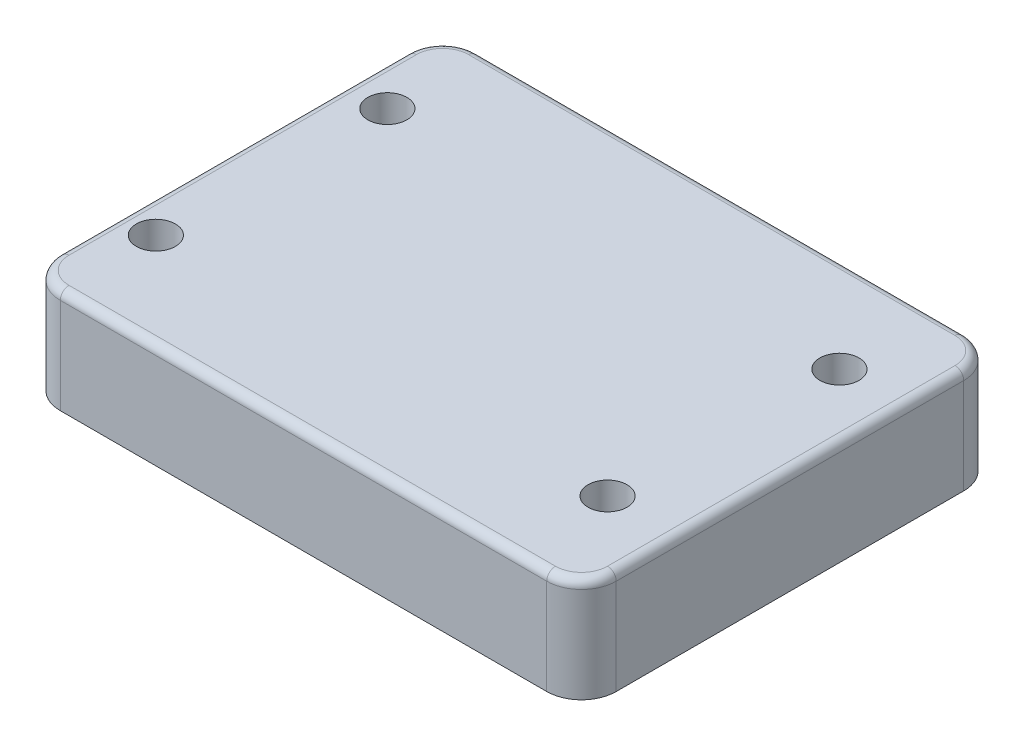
ISO-10303-21;
HEADER;
FILE_DESCRIPTION(('STEP AP214'),'2;1');
FILE_NAME('part.step','',(''),(''),'','','');
FILE_SCHEMA(('AUTOMOTIVE_DESIGN { 1 0 10303 214 1 1 1 1 }'));
ENDSEC;
DATA;
#1=APPLICATION_CONTEXT('core data for automotive mechanical design processes');
#2=APPLICATION_PROTOCOL_DEFINITION('international standard','automotive_design',2000,#1);
#3=PRODUCT_CONTEXT('',#1,'mechanical');
#4=PRODUCT('Part','Part','',(#3));
#5=PRODUCT_RELATED_PRODUCT_CATEGORY('part','',(#4));
#6=PRODUCT_DEFINITION_FORMATION('','',#4);
#7=PRODUCT_DEFINITION_CONTEXT('part definition',#1,'design');
#8=PRODUCT_DEFINITION('design','',#6,#7);
#9=PRODUCT_DEFINITION_SHAPE('','',#8);
#10=(LENGTH_UNIT() NAMED_UNIT(*) SI_UNIT(.MILLI.,.METRE.));
#11=(NAMED_UNIT(*) PLANE_ANGLE_UNIT() SI_UNIT($,.RADIAN.));
#12=(NAMED_UNIT(*) SI_UNIT($,.STERADIAN.) SOLID_ANGLE_UNIT());
#13=UNCERTAINTY_MEASURE_WITH_UNIT(LENGTH_MEASURE(1.E-05),#10,'distance_accuracy_value','');
#14=(GEOMETRIC_REPRESENTATION_CONTEXT(3) GLOBAL_UNCERTAINTY_ASSIGNED_CONTEXT((#13)) GLOBAL_UNIT_ASSIGNED_CONTEXT((#10,
#11,#12)) REPRESENTATION_CONTEXT('',''));
#15=CARTESIAN_POINT('',(0.,0.,0.));
#16=DIRECTION('',(0.,0.,1.));
#17=DIRECTION('',(1.,0.,0.));
#18=AXIS2_PLACEMENT_3D('',#15,#16,#17);
#19=CARTESIAN_POINT('',(6.34999999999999,19.05,0.));
#20=DIRECTION('',(1.,0.,0.));
#21=DIRECTION('',(0.,0.,-1.));
#22=AXIS2_PLACEMENT_3D('',#19,#20,#21);
#23=PLANE('',#22);
#24=DIRECTION('',(0.,-1.,0.));
#25=VECTOR('',#24,1.);
#26=CARTESIAN_POINT('',(6.34999999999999,19.05,-6.35));
#27=LINE('',#26,#25);
#28=CARTESIAN_POINT('',(6.34999999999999,0.,-6.35));
#29=VERTEX_POINT('',#28);
#30=CARTESIAN_POINT('',(6.34999999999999,17.4625,-6.35));
#31=VERTEX_POINT('',#30);
#32=EDGE_CURVE('E159',#29,#31,#27,.F.);
#33=ORIENTED_EDGE('',*,*,#32,.T.);
#34=DIRECTION('',(0.,0.,1.));
#35=VECTOR('',#34,1.);
#36=CARTESIAN_POINT('',(6.34999999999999,17.4625,0.));
#37=LINE('',#36,#35);
#38=CARTESIAN_POINT('',(6.34999999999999,17.4625,-69.85));
#39=VERTEX_POINT('',#38);
#40=EDGE_CURVE('E188',#31,#39,#37,.F.);
#41=ORIENTED_EDGE('',*,*,#40,.T.);
#42=DIRECTION('',(0.,-1.,0.));
#43=VECTOR('',#42,1.);
#44=CARTESIAN_POINT('',(6.34999999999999,19.05,-69.85));
#45=LINE('',#44,#43);
#46=CARTESIAN_POINT('',(6.34999999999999,0.,-69.85));
#47=VERTEX_POINT('',#46);
#48=EDGE_CURVE('E162',#39,#47,#45,.T.);
#49=ORIENTED_EDGE('',*,*,#48,.T.);
#50=DIRECTION('',(0.,0.,1.));
#51=VECTOR('',#50,1.);
#52=CARTESIAN_POINT('',(6.34999999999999,0.,0.));
#53=LINE('',#52,#51);
#54=EDGE_CURVE('E216',#47,#29,#53,.T.);
#55=ORIENTED_EDGE('',*,*,#54,.T.);
#56=EDGE_LOOP('',(#33,#41,#49,#55));
#57=FACE_BOUND('',#56,.T.);
#58=ADVANCED_FACE('F30',(#57),#23,.F.);
#59=CARTESIAN_POINT('',(6.34999999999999,19.05,0.));
#60=DIRECTION('',(0.,0.,-1.));
#61=DIRECTION('',(-1.,0.,0.));
#62=AXIS2_PLACEMENT_3D('',#59,#60,#61);
#63=PLANE('',#62);
#64=DIRECTION('',(0.,-1.,0.));
#65=VECTOR('',#64,1.);
#66=CARTESIAN_POINT('',(101.6,19.05,0.));
#67=LINE('',#66,#65);
#68=CARTESIAN_POINT('',(101.6,0.,0.));
#69=VERTEX_POINT('',#68);
#70=CARTESIAN_POINT('',(101.6,17.4625,0.));
#71=VERTEX_POINT('',#70);
#72=EDGE_CURVE('E156',#69,#71,#67,.F.);
#73=ORIENTED_EDGE('',*,*,#72,.T.);
#74=DIRECTION('',(1.,0.,0.));
#75=VECTOR('',#74,1.);
#76=CARTESIAN_POINT('',(6.34999999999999,17.4625,0.));
#77=LINE('',#76,#75);
#78=CARTESIAN_POINT('',(12.7,17.4625,0.));
#79=VERTEX_POINT('',#78);
#80=EDGE_CURVE('E184',#71,#79,#77,.F.);
#81=ORIENTED_EDGE('',*,*,#80,.T.);
#82=DIRECTION('',(0.,-1.,0.));
#83=VECTOR('',#82,1.);
#84=CARTESIAN_POINT('',(12.7,19.05,0.));
#85=LINE('',#84,#83);
#86=CARTESIAN_POINT('',(12.7,0.,0.));
#87=VERTEX_POINT('',#86);
#88=EDGE_CURVE('E154',#79,#87,#85,.T.);
#89=ORIENTED_EDGE('',*,*,#88,.T.);
#90=DIRECTION('',(1.,0.,0.));
#91=VECTOR('',#90,1.);
#92=CARTESIAN_POINT('',(6.34999999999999,0.,0.));
#93=LINE('',#92,#91);
#94=EDGE_CURVE('E145',#87,#69,#93,.T.);
#95=ORIENTED_EDGE('',*,*,#94,.T.);
#96=EDGE_LOOP('',(#73,#81,#89,#95));
#97=FACE_BOUND('',#96,.T.);
#98=ADVANCED_FACE('F310',(#97),#63,.F.);
#99=CARTESIAN_POINT('',(107.95,19.05,0.));
#100=DIRECTION('',(-1.,0.,0.));
#101=DIRECTION('',(0.,0.,1.));
#102=AXIS2_PLACEMENT_3D('',#99,#100,#101);
#103=PLANE('',#102);
#104=DIRECTION('',(0.,-1.,0.));
#105=VECTOR('',#104,1.);
#106=CARTESIAN_POINT('',(107.95,19.05,-69.85));
#107=LINE('',#106,#105);
#108=CARTESIAN_POINT('',(107.95,0.,-69.85));
#109=VERTEX_POINT('',#108);
#110=CARTESIAN_POINT('',(107.95,17.4625,-69.85));
#111=VERTEX_POINT('',#110);
#112=EDGE_CURVE('E131',#109,#111,#107,.F.);
#113=ORIENTED_EDGE('',*,*,#112,.T.);
#114=DIRECTION('',(0.,0.,-1.));
#115=VECTOR('',#114,1.);
#116=CARTESIAN_POINT('',(107.95,17.4625,0.));
#117=LINE('',#116,#115);
#118=CARTESIAN_POINT('',(107.95,17.4625,-6.35));
#119=VERTEX_POINT('',#118);
#120=EDGE_CURVE('E11',#111,#119,#117,.F.);
#121=ORIENTED_EDGE('',*,*,#120,.T.);
#122=DIRECTION('',(0.,-1.,0.));
#123=VECTOR('',#122,1.);
#124=CARTESIAN_POINT('',(107.95,19.05,-6.35));
#125=LINE('',#124,#123);
#126=CARTESIAN_POINT('',(107.95,0.,-6.35));
#127=VERTEX_POINT('',#126);
#128=EDGE_CURVE('E135',#119,#127,#125,.T.);
#129=ORIENTED_EDGE('',*,*,#128,.T.);
#130=DIRECTION('',(0.,0.,-1.));
#131=VECTOR('',#130,1.);
#132=CARTESIAN_POINT('',(107.95,0.,0.));
#133=LINE('',#132,#131);
#134=EDGE_CURVE('E142',#127,#109,#133,.T.);
#135=ORIENTED_EDGE('',*,*,#134,.T.);
#136=EDGE_LOOP('',(#113,#121,#129,#135));
#137=FACE_BOUND('',#136,.T.);
#138=ADVANCED_FACE('F315',(#137),#103,.F.);
#139=CARTESIAN_POINT('',(6.34999999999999,19.05,-76.2));
#140=DIRECTION('',(0.,0.,1.));
#141=DIRECTION('',(1.,0.,0.));
#142=AXIS2_PLACEMENT_3D('',#139,#140,#141);
#143=PLANE('',#142);
#144=DIRECTION('',(0.,-1.,0.));
#145=VECTOR('',#144,1.);
#146=CARTESIAN_POINT('',(12.7,19.05,-76.2));
#147=LINE('',#146,#145);
#148=CARTESIAN_POINT('',(12.7,0.,-76.2));
#149=VERTEX_POINT('',#148);
#150=CARTESIAN_POINT('',(12.7,17.4625,-76.2));
#151=VERTEX_POINT('',#150);
#152=EDGE_CURVE('E127',#149,#151,#147,.F.);
#153=ORIENTED_EDGE('',*,*,#152,.T.);
#154=DIRECTION('',(-1.,0.,0.));
#155=VECTOR('',#154,1.);
#156=CARTESIAN_POINT('',(6.34999999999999,17.4625,-76.2));
#157=LINE('',#156,#155);
#158=CARTESIAN_POINT('',(101.6,17.4625,-76.2));
#159=VERTEX_POINT('',#158);
#160=EDGE_CURVE('E54',#151,#159,#157,.F.);
#161=ORIENTED_EDGE('',*,*,#160,.T.);
#162=DIRECTION('',(0.,-1.,0.));
#163=VECTOR('',#162,1.);
#164=CARTESIAN_POINT('',(101.6,19.05,-76.2));
#165=LINE('',#164,#163);
#166=CARTESIAN_POINT('',(101.6,0.,-76.2));
#167=VERTEX_POINT('',#166);
#168=EDGE_CURVE('E119',#159,#167,#165,.T.);
#169=ORIENTED_EDGE('',*,*,#168,.T.);
#170=DIRECTION('',(-1.,0.,0.));
#171=VECTOR('',#170,1.);
#172=CARTESIAN_POINT('',(6.34999999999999,0.,-76.2));
#173=LINE('',#172,#171);
#174=EDGE_CURVE('E123',#167,#149,#173,.T.);
#175=ORIENTED_EDGE('',*,*,#174,.T.);
#176=EDGE_LOOP('',(#153,#161,#169,#175));
#177=FACE_BOUND('',#176,.T.);
#178=ADVANCED_FACE('F121',(#177),#143,.F.);
#179=CARTESIAN_POINT('',(6.34999999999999,19.05,-76.2));
#180=DIRECTION('',(0.,-1.,0.));
#181=DIRECTION('',(0.,0.,-1.));
#182=AXIS2_PLACEMENT_3D('',#179,#180,#181);
#183=PLANE('',#182);
#184=CARTESIAN_POINT('',(12.7,19.05,-17.4625));
#185=DIRECTION('',(0.,1.,0.));
#186=DIRECTION('',(0.,0.,1.));
#187=AXIS2_PLACEMENT_3D('',#184,#185,#186);
#188=CIRCLE('',#187,3.5687);
#189=CARTESIAN_POINT('',(12.7,19.05,-13.8938));
#190=VERTEX_POINT('',#189);
#191=EDGE_CURVE('E245',#190,#190,#188,.T.);
#192=ORIENTED_EDGE('',*,*,#191,.F.);
#193=EDGE_LOOP('',(#192));
#194=FACE_BOUND('',#193,.T.);
#195=CARTESIAN_POINT('',(96.3737782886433,19.05,-58.7221988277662));
#196=DIRECTION('',(0.,1.,0.));
#197=DIRECTION('',(0.,0.,1.));
#198=AXIS2_PLACEMENT_3D('',#195,#196,#197);
#199=CIRCLE('',#198,3.56870000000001);
#200=CARTESIAN_POINT('',(96.3737782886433,19.05,-55.1534988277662));
#201=VERTEX_POINT('',#200);
#202=EDGE_CURVE('E239',#201,#201,#199,.T.);
#203=ORIENTED_EDGE('',*,*,#202,.F.);
#204=EDGE_LOOP('',(#203));
#205=FACE_BOUND('',#204,.T.);
#206=CARTESIAN_POINT('',(95.25,19.05,-17.4625));
#207=DIRECTION('',(0.,1.,0.));
#208=DIRECTION('',(0.,0.,1.));
#209=AXIS2_PLACEMENT_3D('',#206,#207,#208);
#210=CIRCLE('',#209,3.5687);
#211=CARTESIAN_POINT('',(95.25,19.05,-13.8938));
#212=VERTEX_POINT('',#211);
#213=EDGE_CURVE('E233',#212,#212,#210,.T.);
#214=ORIENTED_EDGE('',*,*,#213,.F.);
#215=EDGE_LOOP('',(#214));
#216=FACE_BOUND('',#215,.T.);
#217=CARTESIAN_POINT('',(13.8238123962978,19.05,-58.6471576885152));
#218=DIRECTION('',(0.,1.,0.));
#219=DIRECTION('',(0.,0.,1.));
#220=AXIS2_PLACEMENT_3D('',#217,#218,#219);
#221=CIRCLE('',#220,3.5687);
#222=CARTESIAN_POINT('',(13.8238123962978,19.05,-55.0784576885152));
#223=VERTEX_POINT('',#222);
#224=EDGE_CURVE('E227',#223,#223,#221,.T.);
#225=ORIENTED_EDGE('',*,*,#224,.F.);
#226=EDGE_LOOP('',(#225));
#227=FACE_BOUND('',#226,.T.);
#228=DIRECTION('',(1.,0.,0.));
#229=VECTOR('',#228,1.);
#230=CARTESIAN_POINT('',(6.34999999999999,19.05,-1.58750000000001));
#231=LINE('',#230,#229);
#232=CARTESIAN_POINT('',(12.7,19.05,-1.5875));
#233=VERTEX_POINT('',#232);
#234=CARTESIAN_POINT('',(101.6,19.05,-1.58750000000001));
#235=VERTEX_POINT('',#234);
#236=EDGE_CURVE('E176',#233,#235,#231,.T.);
#237=ORIENTED_EDGE('',*,*,#236,.T.);
#238=CARTESIAN_POINT('',(101.6,19.05,-6.35));
#239=DIRECTION('',(0.,-1.,0.));
#240=DIRECTION('',(0.,0.,-1.));
#241=AXIS2_PLACEMENT_3D('',#238,#239,#240);
#242=CIRCLE('',#241,4.7625);
#243=CARTESIAN_POINT('',(106.3625,19.05,-6.35));
#244=VERTEX_POINT('',#243);
#245=EDGE_CURVE('E178',#235,#244,#242,.F.);
#246=ORIENTED_EDGE('',*,*,#245,.T.);
#247=DIRECTION('',(0.,0.,-1.));
#248=VECTOR('',#247,1.);
#249=CARTESIAN_POINT('',(106.3625,19.05,-76.2));
#250=LINE('',#249,#248);
#251=CARTESIAN_POINT('',(106.3625,19.05,-69.85));
#252=VERTEX_POINT('',#251);
#253=EDGE_CURVE('E164',#244,#252,#250,.T.);
#254=ORIENTED_EDGE('',*,*,#253,.T.);
#255=CARTESIAN_POINT('',(101.6,19.05,-69.85));
#256=DIRECTION('',(0.,-1.,0.));
#257=DIRECTION('',(0.,0.,-1.));
#258=AXIS2_PLACEMENT_3D('',#255,#256,#257);
#259=CIRCLE('',#258,4.7625);
#260=CARTESIAN_POINT('',(101.6,19.05,-74.6125));
#261=VERTEX_POINT('',#260);
#262=EDGE_CURVE('E166',#252,#261,#259,.F.);
#263=ORIENTED_EDGE('',*,*,#262,.T.);
#264=DIRECTION('',(-1.,0.,0.));
#265=VECTOR('',#264,1.);
#266=CARTESIAN_POINT('',(6.34999999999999,19.05,-74.6125));
#267=LINE('',#266,#265);
#268=CARTESIAN_POINT('',(12.7,19.05,-74.6125));
#269=VERTEX_POINT('',#268);
#270=EDGE_CURVE('E168',#261,#269,#267,.T.);
#271=ORIENTED_EDGE('',*,*,#270,.T.);
#272=CARTESIAN_POINT('',(12.7,19.05,-69.85));
#273=DIRECTION('',(0.,-1.,0.));
#274=DIRECTION('',(0.,0.,-1.));
#275=AXIS2_PLACEMENT_3D('',#272,#273,#274);
#276=CIRCLE('',#275,4.7625);
#277=CARTESIAN_POINT('',(7.93749999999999,19.05,-69.85));
#278=VERTEX_POINT('',#277);
#279=EDGE_CURVE('E170',#269,#278,#276,.F.);
#280=ORIENTED_EDGE('',*,*,#279,.T.);
#281=DIRECTION('',(0.,0.,1.));
#282=VECTOR('',#281,1.);
#283=CARTESIAN_POINT('',(7.93749999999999,19.05,-76.2));
#284=LINE('',#283,#282);
#285=CARTESIAN_POINT('',(7.93749999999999,19.05,-6.35));
#286=VERTEX_POINT('',#285);
#287=EDGE_CURVE('E172',#278,#286,#284,.T.);
#288=ORIENTED_EDGE('',*,*,#287,.T.);
#289=CARTESIAN_POINT('',(12.7,19.05,-6.35));
#290=DIRECTION('',(0.,-1.,0.));
#291=DIRECTION('',(0.,0.,-1.));
#292=AXIS2_PLACEMENT_3D('',#289,#290,#291);
#293=CIRCLE('',#292,4.7625);
#294=EDGE_CURVE('E174',#286,#233,#293,.F.);
#295=ORIENTED_EDGE('',*,*,#294,.T.);
#296=EDGE_LOOP('',(#237,#246,#254,#263,#271,#280,#288,#295));
#297=FACE_BOUND('',#296,.T.);
#298=ADVANCED_FACE('F260',(#194,#205,#216,#227,#297),#183,.F.);
#299=CARTESIAN_POINT('',(6.34999999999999,0.,-76.2));
#300=DIRECTION('',(0.,-1.,0.));
#301=DIRECTION('',(0.,0.,-1.));
#302=AXIS2_PLACEMENT_3D('',#299,#300,#301);
#303=PLANE('',#302);
#304=CARTESIAN_POINT('',(12.7,0.,-17.4625));
#305=DIRECTION('',(0.,1.,0.));
#306=DIRECTION('',(0.,0.,1.));
#307=AXIS2_PLACEMENT_3D('',#304,#305,#306);
#308=CIRCLE('',#307,3.5687);
#309=CARTESIAN_POINT('',(12.7,0.,-13.8938));
#310=VERTEX_POINT('',#309);
#311=EDGE_CURVE('E242',#310,#310,#308,.T.);
#312=ORIENTED_EDGE('',*,*,#311,.T.);
#313=EDGE_LOOP('',(#312));
#314=FACE_BOUND('',#313,.T.);
#315=CARTESIAN_POINT('',(96.3737782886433,0.,-58.7221988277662));
#316=DIRECTION('',(0.,1.,0.));
#317=DIRECTION('',(0.,0.,1.));
#318=AXIS2_PLACEMENT_3D('',#315,#316,#317);
#319=CIRCLE('',#318,3.56870000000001);
#320=CARTESIAN_POINT('',(96.3737782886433,0.,-55.1534988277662));
#321=VERTEX_POINT('',#320);
#322=EDGE_CURVE('E236',#321,#321,#319,.T.);
#323=ORIENTED_EDGE('',*,*,#322,.T.);
#324=EDGE_LOOP('',(#323));
#325=FACE_BOUND('',#324,.T.);
#326=CARTESIAN_POINT('',(95.25,0.,-17.4625));
#327=DIRECTION('',(0.,1.,0.));
#328=DIRECTION('',(0.,0.,1.));
#329=AXIS2_PLACEMENT_3D('',#326,#327,#328);
#330=CIRCLE('',#329,3.5687);
#331=CARTESIAN_POINT('',(95.25,0.,-13.8938));
#332=VERTEX_POINT('',#331);
#333=EDGE_CURVE('E230',#332,#332,#330,.T.);
#334=ORIENTED_EDGE('',*,*,#333,.T.);
#335=EDGE_LOOP('',(#334));
#336=FACE_BOUND('',#335,.T.);
#337=CARTESIAN_POINT('',(13.8238123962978,0.,-58.6471576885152));
#338=DIRECTION('',(0.,1.,0.));
#339=DIRECTION('',(0.,0.,1.));
#340=AXIS2_PLACEMENT_3D('',#337,#338,#339);
#341=CIRCLE('',#340,3.5687);
#342=CARTESIAN_POINT('',(13.8238123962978,0.,-55.0784576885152));
#343=VERTEX_POINT('',#342);
#344=EDGE_CURVE('E197',#343,#343,#341,.T.);
#345=ORIENTED_EDGE('',*,*,#344,.T.);
#346=EDGE_LOOP('',(#345));
#347=FACE_BOUND('',#346,.T.);
#348=ORIENTED_EDGE('',*,*,#174,.F.);
#349=CARTESIAN_POINT('',(101.6,0.,-69.85));
#350=DIRECTION('',(0.,-1.,0.));
#351=DIRECTION('',(0.,0.,-1.));
#352=AXIS2_PLACEMENT_3D('',#349,#350,#351);
#353=CIRCLE('',#352,6.35);
#354=EDGE_CURVE('E129',#167,#109,#353,.T.);
#355=ORIENTED_EDGE('',*,*,#354,.T.);
#356=ORIENTED_EDGE('',*,*,#134,.F.);
#357=CARTESIAN_POINT('',(101.6,0.,-6.35));
#358=DIRECTION('',(0.,-1.,0.));
#359=DIRECTION('',(0.,0.,-1.));
#360=AXIS2_PLACEMENT_3D('',#357,#358,#359);
#361=CIRCLE('',#360,6.35);
#362=EDGE_CURVE('E136',#127,#69,#361,.T.);
#363=ORIENTED_EDGE('',*,*,#362,.T.);
#364=ORIENTED_EDGE('',*,*,#94,.F.);
#365=CARTESIAN_POINT('',(12.7,0.,-6.35));
#366=DIRECTION('',(0.,-1.,0.));
#367=DIRECTION('',(0.,0.,-1.));
#368=AXIS2_PLACEMENT_3D('',#365,#366,#367);
#369=CIRCLE('',#368,6.35);
#370=EDGE_CURVE('E126',#87,#29,#369,.T.);
#371=ORIENTED_EDGE('',*,*,#370,.T.);
#372=ORIENTED_EDGE('',*,*,#54,.F.);
#373=CARTESIAN_POINT('',(12.7,0.,-69.85));
#374=DIRECTION('',(0.,-1.,0.));
#375=DIRECTION('',(0.,0.,-1.));
#376=AXIS2_PLACEMENT_3D('',#373,#374,#375);
#377=CIRCLE('',#376,6.35);
#378=EDGE_CURVE('E141',#47,#149,#377,.T.);
#379=ORIENTED_EDGE('',*,*,#378,.T.);
#380=EDGE_LOOP('',(#348,#355,#356,#363,#364,#371,#372,#379));
#381=FACE_BOUND('',#380,.T.);
#382=ADVANCED_FACE('F138',(#314,#325,#336,#347,#381),#303,.T.);
#383=CARTESIAN_POINT('',(101.6,19.05,-69.85));
#384=DIRECTION('',(0.,-1.,0.));
#385=DIRECTION('',(0.,0.,-1.));
#386=AXIS2_PLACEMENT_3D('',#383,#384,#385);
#387=CYLINDRICAL_SURFACE('',#386,6.35);
#388=ORIENTED_EDGE('',*,*,#168,.F.);
#389=CARTESIAN_POINT('',(101.6,17.4625,-69.85));
#390=DIRECTION('',(0.,-1.,0.));
#391=DIRECTION('',(0.,0.,-1.));
#392=AXIS2_PLACEMENT_3D('',#389,#390,#391);
#393=CIRCLE('',#392,6.35);
#394=EDGE_CURVE('E39',#159,#111,#393,.T.);
#395=ORIENTED_EDGE('',*,*,#394,.T.);
#396=ORIENTED_EDGE('',*,*,#112,.F.);
#397=ORIENTED_EDGE('',*,*,#354,.F.);
#398=EDGE_LOOP('',(#388,#395,#396,#397));
#399=FACE_BOUND('',#398,.T.);
#400=ADVANCED_FACE('F130',(#399),#387,.T.);
#401=CARTESIAN_POINT('',(101.6,19.05,-6.35));
#402=DIRECTION('',(0.,-1.,0.));
#403=DIRECTION('',(0.,0.,-1.));
#404=AXIS2_PLACEMENT_3D('',#401,#402,#403);
#405=CYLINDRICAL_SURFACE('',#404,6.35);
#406=ORIENTED_EDGE('',*,*,#128,.F.);
#407=CARTESIAN_POINT('',(101.6,17.4625,-6.35));
#408=DIRECTION('',(0.,-1.,0.));
#409=DIRECTION('',(0.,0.,-1.));
#410=AXIS2_PLACEMENT_3D('',#407,#408,#409);
#411=CIRCLE('',#410,6.35);
#412=EDGE_CURVE('E181',#119,#71,#411,.T.);
#413=ORIENTED_EDGE('',*,*,#412,.T.);
#414=ORIENTED_EDGE('',*,*,#72,.F.);
#415=ORIENTED_EDGE('',*,*,#362,.F.);
#416=EDGE_LOOP('',(#406,#413,#414,#415));
#417=FACE_BOUND('',#416,.T.);
#418=ADVANCED_FACE('F313',(#417),#405,.T.);
#419=CARTESIAN_POINT('',(12.7,19.05,-69.85));
#420=DIRECTION('',(0.,-1.,0.));
#421=DIRECTION('',(0.,0.,-1.));
#422=AXIS2_PLACEMENT_3D('',#419,#420,#421);
#423=CYLINDRICAL_SURFACE('',#422,6.35);
#424=ORIENTED_EDGE('',*,*,#48,.F.);
#425=CARTESIAN_POINT('',(12.7,17.4625,-69.85));
#426=DIRECTION('',(0.,-1.,0.));
#427=DIRECTION('',(0.,0.,-1.));
#428=AXIS2_PLACEMENT_3D('',#425,#426,#427);
#429=CIRCLE('',#428,6.35);
#430=EDGE_CURVE('E190',#39,#151,#429,.T.);
#431=ORIENTED_EDGE('',*,*,#430,.T.);
#432=ORIENTED_EDGE('',*,*,#152,.F.);
#433=ORIENTED_EDGE('',*,*,#378,.F.);
#434=EDGE_LOOP('',(#424,#431,#432,#433));
#435=FACE_BOUND('',#434,.T.);
#436=ADVANCED_FACE('F305',(#435),#423,.T.);
#437=CARTESIAN_POINT('',(12.7,19.05,-6.35));
#438=DIRECTION('',(0.,-1.,0.));
#439=DIRECTION('',(0.,0.,-1.));
#440=AXIS2_PLACEMENT_3D('',#437,#438,#439);
#441=CYLINDRICAL_SURFACE('',#440,6.35);
#442=ORIENTED_EDGE('',*,*,#88,.F.);
#443=CARTESIAN_POINT('',(12.7,17.4625,-6.35));
#444=DIRECTION('',(0.,-1.,0.));
#445=DIRECTION('',(0.,0.,-1.));
#446=AXIS2_PLACEMENT_3D('',#443,#444,#445);
#447=CIRCLE('',#446,6.35);
#448=EDGE_CURVE('E186',#79,#31,#447,.T.);
#449=ORIENTED_EDGE('',*,*,#448,.T.);
#450=ORIENTED_EDGE('',*,*,#32,.F.);
#451=ORIENTED_EDGE('',*,*,#370,.F.);
#452=EDGE_LOOP('',(#442,#449,#450,#451));
#453=FACE_BOUND('',#452,.T.);
#454=ADVANCED_FACE('F301',(#453),#441,.T.);
#455=CARTESIAN_POINT('',(12.7,17.4625,-69.85));
#456=DIRECTION('',(0.,-1.,0.));
#457=DIRECTION('',(0.,0.,-1.));
#458=AXIS2_PLACEMENT_3D('',#455,#456,#457);
#459=TOROIDAL_SURFACE('',#458,4.7625,1.5875);
#460=CARTESIAN_POINT('',(12.7,17.4625,-74.6125));
#461=DIRECTION('',(1.,0.,0.));
#462=DIRECTION('',(0.,0.,-1.));
#463=AXIS2_PLACEMENT_3D('',#460,#461,#462);
#464=CIRCLE('',#463,1.5875);
#465=EDGE_CURVE('E210',#151,#269,#464,.T.);
#466=ORIENTED_EDGE('',*,*,#465,.F.);
#467=ORIENTED_EDGE('',*,*,#430,.F.);
#468=CARTESIAN_POINT('',(7.93749999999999,17.4625,-69.85));
#469=DIRECTION('',(0.,0.,1.));
#470=DIRECTION('',(1.,0.,0.));
#471=AXIS2_PLACEMENT_3D('',#468,#469,#470);
#472=CIRCLE('',#471,1.5875);
#473=EDGE_CURVE('E34',#278,#39,#472,.T.);
#474=ORIENTED_EDGE('',*,*,#473,.F.);
#475=ORIENTED_EDGE('',*,*,#279,.F.);
#476=EDGE_LOOP('',(#466,#467,#474,#475));
#477=FACE_BOUND('',#476,.T.);
#478=ADVANCED_FACE('F32',(#477),#459,.T.);
#479=CARTESIAN_POINT('',(7.93749999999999,17.4625,-76.2));
#480=DIRECTION('',(0.,0.,1.));
#481=DIRECTION('',(1.,0.,0.));
#482=AXIS2_PLACEMENT_3D('',#479,#480,#481);
#483=CYLINDRICAL_SURFACE('',#482,1.5875);
#484=ORIENTED_EDGE('',*,*,#473,.T.);
#485=ORIENTED_EDGE('',*,*,#40,.F.);
#486=CARTESIAN_POINT('',(7.93749999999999,17.4625,-6.35));
#487=DIRECTION('',(0.,0.,1.));
#488=DIRECTION('',(1.,0.,0.));
#489=AXIS2_PLACEMENT_3D('',#486,#487,#488);
#490=CIRCLE('',#489,1.5875);
#491=EDGE_CURVE('E208',#286,#31,#490,.T.);
#492=ORIENTED_EDGE('',*,*,#491,.F.);
#493=ORIENTED_EDGE('',*,*,#287,.F.);
#494=EDGE_LOOP('',(#484,#485,#492,#493));
#495=FACE_BOUND('',#494,.T.);
#496=ADVANCED_FACE('F295',(#495),#483,.T.);
#497=CARTESIAN_POINT('',(6.34999999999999,17.4625,-74.6125));
#498=DIRECTION('',(-1.,0.,0.));
#499=DIRECTION('',(0.,0.,1.));
#500=AXIS2_PLACEMENT_3D('',#497,#498,#499);
#501=CYLINDRICAL_SURFACE('',#500,1.5875);
#502=ORIENTED_EDGE('',*,*,#465,.T.);
#503=ORIENTED_EDGE('',*,*,#270,.F.);
#504=CARTESIAN_POINT('',(101.6,17.4625,-74.6125));
#505=DIRECTION('',(1.,0.,0.));
#506=DIRECTION('',(0.,0.,-1.));
#507=AXIS2_PLACEMENT_3D('',#504,#505,#506);
#508=CIRCLE('',#507,1.5875);
#509=EDGE_CURVE('E205',#159,#261,#508,.T.);
#510=ORIENTED_EDGE('',*,*,#509,.F.);
#511=ORIENTED_EDGE('',*,*,#160,.F.);
#512=EDGE_LOOP('',(#502,#503,#510,#511));
#513=FACE_BOUND('',#512,.T.);
#514=ADVANCED_FACE('F290',(#513),#501,.T.);
#515=CARTESIAN_POINT('',(12.7,17.4625,-6.35));
#516=DIRECTION('',(0.,-1.,0.));
#517=DIRECTION('',(0.,0.,-1.));
#518=AXIS2_PLACEMENT_3D('',#515,#516,#517);
#519=TOROIDAL_SURFACE('',#518,4.7625,1.5875);
#520=ORIENTED_EDGE('',*,*,#491,.T.);
#521=ORIENTED_EDGE('',*,*,#448,.F.);
#522=CARTESIAN_POINT('',(12.7,17.4625,-1.5875));
#523=DIRECTION('',(1.,0.,0.));
#524=DIRECTION('',(0.,0.,-1.));
#525=AXIS2_PLACEMENT_3D('',#522,#523,#524);
#526=CIRCLE('',#525,1.5875);
#527=EDGE_CURVE('E202',#233,#79,#526,.T.);
#528=ORIENTED_EDGE('',*,*,#527,.F.);
#529=ORIENTED_EDGE('',*,*,#294,.F.);
#530=EDGE_LOOP('',(#520,#521,#528,#529));
#531=FACE_BOUND('',#530,.T.);
#532=ADVANCED_FACE('F298',(#531),#519,.T.);
#533=CARTESIAN_POINT('',(101.6,17.4625,-69.85));
#534=DIRECTION('',(0.,-1.,0.));
#535=DIRECTION('',(0.,0.,-1.));
#536=AXIS2_PLACEMENT_3D('',#533,#534,#535);
#537=TOROIDAL_SURFACE('',#536,4.7625,1.5875);
#538=ORIENTED_EDGE('',*,*,#509,.T.);
#539=ORIENTED_EDGE('',*,*,#262,.F.);
#540=CARTESIAN_POINT('',(106.3625,17.4625,-69.85));
#541=DIRECTION('',(0.,0.,1.));
#542=DIRECTION('',(1.,0.,0.));
#543=AXIS2_PLACEMENT_3D('',#540,#541,#542);
#544=CIRCLE('',#543,1.5875);
#545=EDGE_CURVE('E199',#111,#252,#544,.T.);
#546=ORIENTED_EDGE('',*,*,#545,.F.);
#547=ORIENTED_EDGE('',*,*,#394,.F.);
#548=EDGE_LOOP('',(#538,#539,#546,#547));
#549=FACE_BOUND('',#548,.T.);
#550=ADVANCED_FACE('F289',(#549),#537,.T.);
#551=CARTESIAN_POINT('',(6.34999999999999,17.4625,-1.58750000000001));
#552=DIRECTION('',(1.,0.,0.));
#553=DIRECTION('',(0.,0.,-1.));
#554=AXIS2_PLACEMENT_3D('',#551,#552,#553);
#555=CYLINDRICAL_SURFACE('',#554,1.5875);
#556=ORIENTED_EDGE('',*,*,#527,.T.);
#557=ORIENTED_EDGE('',*,*,#80,.F.);
#558=CARTESIAN_POINT('',(101.6,17.4625,-1.58750000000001));
#559=DIRECTION('',(1.,0.,0.));
#560=DIRECTION('',(0.,0.,-1.));
#561=AXIS2_PLACEMENT_3D('',#558,#559,#560);
#562=CIRCLE('',#561,1.5875);
#563=EDGE_CURVE('E196',#235,#71,#562,.T.);
#564=ORIENTED_EDGE('',*,*,#563,.F.);
#565=ORIENTED_EDGE('',*,*,#236,.F.);
#566=EDGE_LOOP('',(#556,#557,#564,#565));
#567=FACE_BOUND('',#566,.T.);
#568=ADVANCED_FACE('F277',(#567),#555,.T.);
#569=CARTESIAN_POINT('',(106.3625,17.4625,-76.2));
#570=DIRECTION('',(0.,0.,-1.));
#571=DIRECTION('',(-1.,0.,0.));
#572=AXIS2_PLACEMENT_3D('',#569,#570,#571);
#573=CYLINDRICAL_SURFACE('',#572,1.5875);
#574=ORIENTED_EDGE('',*,*,#545,.T.);
#575=ORIENTED_EDGE('',*,*,#253,.F.);
#576=CARTESIAN_POINT('',(106.3625,17.4625,-6.35));
#577=DIRECTION('',(0.,0.,1.));
#578=DIRECTION('',(1.,0.,0.));
#579=AXIS2_PLACEMENT_3D('',#576,#577,#578);
#580=CIRCLE('',#579,1.5875);
#581=EDGE_CURVE('E194',#119,#244,#580,.T.);
#582=ORIENTED_EDGE('',*,*,#581,.F.);
#583=ORIENTED_EDGE('',*,*,#120,.F.);
#584=EDGE_LOOP('',(#574,#575,#582,#583));
#585=FACE_BOUND('',#584,.T.);
#586=ADVANCED_FACE('F285',(#585),#573,.T.);
#587=CARTESIAN_POINT('',(101.6,17.4625,-6.35));
#588=DIRECTION('',(0.,-1.,0.));
#589=DIRECTION('',(0.,0.,-1.));
#590=AXIS2_PLACEMENT_3D('',#587,#588,#589);
#591=TOROIDAL_SURFACE('',#590,4.7625,1.5875);
#592=ORIENTED_EDGE('',*,*,#563,.T.);
#593=ORIENTED_EDGE('',*,*,#412,.F.);
#594=ORIENTED_EDGE('',*,*,#581,.T.);
#595=ORIENTED_EDGE('',*,*,#245,.F.);
#596=EDGE_LOOP('',(#592,#593,#594,#595));
#597=FACE_BOUND('',#596,.T.);
#598=ADVANCED_FACE('F280',(#597),#591,.T.);
#599=CARTESIAN_POINT('',(13.8238123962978,0.,-58.6471576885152));
#600=DIRECTION('',(0.,1.,0.));
#601=DIRECTION('',(0.,0.,1.));
#602=AXIS2_PLACEMENT_3D('',#599,#600,#601);
#603=CYLINDRICAL_SURFACE('',#602,3.5687);
#604=CARTESIAN_POINT('',(13.8238123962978,0.,-55.0784576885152));
#605=CARTESIAN_POINT('',(13.8238123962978,0.1984375,-55.0784576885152));
#606=CARTESIAN_POINT('',(13.8238123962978,0.396875,-55.0784576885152));
#607=CARTESIAN_POINT('',(13.8238123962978,0.79375,-55.0784576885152));
#608=CARTESIAN_POINT('',(13.8238123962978,0.9921875,-55.0784576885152));
#609=CARTESIAN_POINT('',(13.8238123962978,1.3890625,-55.0784576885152));
#610=CARTESIAN_POINT('',(13.8238123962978,1.5875,-55.0784576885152));
#611=CARTESIAN_POINT('',(13.8238123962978,1.984375,-55.0784576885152));
#612=CARTESIAN_POINT('',(13.8238123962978,2.1828125,-55.0784576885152));
#613=CARTESIAN_POINT('',(13.8238123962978,2.5796875,-55.0784576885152));
#614=CARTESIAN_POINT('',(13.8238123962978,2.778125,-55.0784576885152));
#615=CARTESIAN_POINT('',(13.8238123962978,3.175,-55.0784576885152));
#616=CARTESIAN_POINT('',(13.8238123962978,3.3734375,-55.0784576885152));
#617=CARTESIAN_POINT('',(13.8238123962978,3.7703125,-55.0784576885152));
#618=CARTESIAN_POINT('',(13.8238123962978,3.96875,-55.0784576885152));
#619=CARTESIAN_POINT('',(13.8238123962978,4.365625,-55.0784576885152));
#620=CARTESIAN_POINT('',(13.8238123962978,4.5640625,-55.0784576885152));
#621=CARTESIAN_POINT('',(13.8238123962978,4.9609375,-55.0784576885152));
#622=CARTESIAN_POINT('',(13.8238123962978,5.159375,-55.0784576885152));
#623=CARTESIAN_POINT('',(13.8238123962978,5.55625,-55.0784576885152));
#624=CARTESIAN_POINT('',(13.8238123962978,5.7546875,-55.0784576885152));
#625=CARTESIAN_POINT('',(13.8238123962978,6.1515625,-55.0784576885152));
#626=CARTESIAN_POINT('',(13.8238123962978,6.35,-55.0784576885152));
#627=CARTESIAN_POINT('',(13.8238123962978,6.746875,-55.0784576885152));
#628=CARTESIAN_POINT('',(13.8238123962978,6.9453125,-55.0784576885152));
#629=CARTESIAN_POINT('',(13.8238123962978,7.3421875,-55.0784576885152));
#630=CARTESIAN_POINT('',(13.8238123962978,7.540625,-55.0784576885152));
#631=CARTESIAN_POINT('',(13.8238123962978,7.9375,-55.0784576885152));
#632=CARTESIAN_POINT('',(13.8238123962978,8.1359375,-55.0784576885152));
#633=CARTESIAN_POINT('',(13.8238123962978,8.5328125,-55.0784576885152));
#634=CARTESIAN_POINT('',(13.8238123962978,8.73125,-55.0784576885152));
#635=CARTESIAN_POINT('',(13.8238123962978,9.128125,-55.0784576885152));
#636=CARTESIAN_POINT('',(13.8238123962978,9.3265625,-55.0784576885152));
#637=CARTESIAN_POINT('',(13.8238123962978,9.7234375,-55.0784576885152));
#638=CARTESIAN_POINT('',(13.8238123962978,9.921875,-55.0784576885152));
#639=CARTESIAN_POINT('',(13.8238123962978,10.31875,-55.0784576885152));
#640=CARTESIAN_POINT('',(13.8238123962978,10.5171875,-55.0784576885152));
#641=CARTESIAN_POINT('',(13.8238123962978,10.9140625,-55.0784576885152));
#642=CARTESIAN_POINT('',(13.8238123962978,11.1125,-55.0784576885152));
#643=CARTESIAN_POINT('',(13.8238123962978,11.509375,-55.0784576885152));
#644=CARTESIAN_POINT('',(13.8238123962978,11.7078125,-55.0784576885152));
#645=CARTESIAN_POINT('',(13.8238123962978,12.1046875,-55.0784576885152));
#646=CARTESIAN_POINT('',(13.8238123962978,12.303125,-55.0784576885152));
#647=CARTESIAN_POINT('',(13.8238123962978,12.7,-55.0784576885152));
#648=CARTESIAN_POINT('',(13.8238123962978,12.8984375,-55.0784576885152));
#649=CARTESIAN_POINT('',(13.8238123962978,13.2953125,-55.0784576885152));
#650=CARTESIAN_POINT('',(13.8238123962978,13.49375,-55.0784576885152));
#651=CARTESIAN_POINT('',(13.8238123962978,13.890625,-55.0784576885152));
#652=CARTESIAN_POINT('',(13.8238123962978,14.0890625,-55.0784576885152));
#653=CARTESIAN_POINT('',(13.8238123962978,14.4859375,-55.0784576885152));
#654=CARTESIAN_POINT('',(13.8238123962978,14.684375,-55.0784576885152));
#655=CARTESIAN_POINT('',(13.8238123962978,15.08125,-55.0784576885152));
#656=CARTESIAN_POINT('',(13.8238123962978,15.2796875,-55.0784576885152));
#657=CARTESIAN_POINT('',(13.8238123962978,15.6765625,-55.0784576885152));
#658=CARTESIAN_POINT('',(13.8238123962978,15.875,-55.0784576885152));
#659=CARTESIAN_POINT('',(13.8238123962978,16.271875,-55.0784576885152));
#660=CARTESIAN_POINT('',(13.8238123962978,16.4703125,-55.0784576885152));
#661=CARTESIAN_POINT('',(13.8238123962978,16.8671875,-55.0784576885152));
#662=CARTESIAN_POINT('',(13.8238123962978,17.065625,-55.0784576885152));
#663=CARTESIAN_POINT('',(13.8238123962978,17.4625,-55.0784576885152));
#664=CARTESIAN_POINT('',(13.8238123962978,17.6609375,-55.0784576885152));
#665=CARTESIAN_POINT('',(13.8238123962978,18.0578125,-55.0784576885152));
#666=CARTESIAN_POINT('',(13.8238123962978,18.25625,-55.0784576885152));
#667=CARTESIAN_POINT('',(13.8238123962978,18.653125,-55.0784576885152));
#668=CARTESIAN_POINT('',(13.8238123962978,18.8515625,-55.0784576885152));
#669=CARTESIAN_POINT('',(13.8238123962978,19.05,-55.0784576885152));
#670=B_SPLINE_CURVE_WITH_KNOTS('',3,(#604,#605,#606,#607,#608,#609,#610,#611,#612,#613,#614,
#615,#616,#617,#618,#619,#620,#621,#622,#623,#624,#625,#626,#627,#628,#629,#630,#631,#632,#633,
#634,#635,#636,#637,#638,#639,#640,#641,#642,#643,#644,#645,#646,#647,#648,#649,#650,#651,#652,
#653,#654,#655,#656,#657,#658,#659,#660,#661,#662,#663,#664,#665,#666,#667,#668,#669),
.UNSPECIFIED.,.F.,.F.,(4,2,2,2,2,2,2,2,2,2,2,2,2,2,2,2,2,2,2,2,2,2,2,2,2,2,2,2,2,2,2,2,4),(0.,
0.5953125,1.190625,1.7859375,2.38125,2.9765625,3.571875,4.1671875,4.7625,5.3578125,5.953125,
6.5484375,7.14375,7.7390625,8.334375,8.9296875,9.525,10.1203125,10.715625,11.3109375,11.90625,
12.5015625,13.096875,13.6921875,14.2875,14.8828125,15.478125,16.0734375,16.66875,17.2640625,
17.859375,18.4546875,19.05),.UNSPECIFIED.);
#671=EDGE_CURVE('BSEAM339',#343,#223,#670,.T.);
#672=ORIENTED_EDGE('',*,*,#344,.F.);
#673=ORIENTED_EDGE('',*,*,#224,.T.);
#674=ORIENTED_EDGE('',*,*,#671,.T.);
#675=ORIENTED_EDGE('',*,*,#671,.F.);
#676=EDGE_LOOP('',(#672,#674,#673,#675));
#677=FACE_BOUND('',#676,.T.);
#678=ADVANCED_FACE('F339',(#677),#603,.F.);
#679=CARTESIAN_POINT('',(95.25,0.,-17.4625));
#680=DIRECTION('',(0.,1.,0.));
#681=DIRECTION('',(0.,0.,1.));
#682=AXIS2_PLACEMENT_3D('',#679,#680,#681);
#683=CYLINDRICAL_SURFACE('',#682,3.5687);
#684=CARTESIAN_POINT('',(95.25,0.,-13.8938));
#685=CARTESIAN_POINT('',(95.25,0.1984375,-13.8938));
#686=CARTESIAN_POINT('',(95.25,0.396875,-13.8938));
#687=CARTESIAN_POINT('',(95.25,0.79375,-13.8938));
#688=CARTESIAN_POINT('',(95.25,0.9921875,-13.8938));
#689=CARTESIAN_POINT('',(95.25,1.3890625,-13.8938));
#690=CARTESIAN_POINT('',(95.25,1.5875,-13.8938));
#691=CARTESIAN_POINT('',(95.25,1.984375,-13.8938));
#692=CARTESIAN_POINT('',(95.25,2.1828125,-13.8938));
#693=CARTESIAN_POINT('',(95.25,2.5796875,-13.8938));
#694=CARTESIAN_POINT('',(95.25,2.778125,-13.8938));
#695=CARTESIAN_POINT('',(95.25,3.175,-13.8938));
#696=CARTESIAN_POINT('',(95.25,3.3734375,-13.8938));
#697=CARTESIAN_POINT('',(95.25,3.7703125,-13.8938));
#698=CARTESIAN_POINT('',(95.25,3.96875,-13.8938));
#699=CARTESIAN_POINT('',(95.25,4.365625,-13.8938));
#700=CARTESIAN_POINT('',(95.25,4.5640625,-13.8938));
#701=CARTESIAN_POINT('',(95.25,4.9609375,-13.8938));
#702=CARTESIAN_POINT('',(95.25,5.159375,-13.8938));
#703=CARTESIAN_POINT('',(95.25,5.55625,-13.8938));
#704=CARTESIAN_POINT('',(95.25,5.7546875,-13.8938));
#705=CARTESIAN_POINT('',(95.25,6.1515625,-13.8938));
#706=CARTESIAN_POINT('',(95.25,6.35,-13.8938));
#707=CARTESIAN_POINT('',(95.25,6.746875,-13.8938));
#708=CARTESIAN_POINT('',(95.25,6.9453125,-13.8938));
#709=CARTESIAN_POINT('',(95.25,7.3421875,-13.8938));
#710=CARTESIAN_POINT('',(95.25,7.540625,-13.8938));
#711=CARTESIAN_POINT('',(95.25,7.9375,-13.8938));
#712=CARTESIAN_POINT('',(95.25,8.1359375,-13.8938));
#713=CARTESIAN_POINT('',(95.25,8.5328125,-13.8938));
#714=CARTESIAN_POINT('',(95.25,8.73125,-13.8938));
#715=CARTESIAN_POINT('',(95.25,9.128125,-13.8938));
#716=CARTESIAN_POINT('',(95.25,9.3265625,-13.8938));
#717=CARTESIAN_POINT('',(95.25,9.7234375,-13.8938));
#718=CARTESIAN_POINT('',(95.25,9.921875,-13.8938));
#719=CARTESIAN_POINT('',(95.25,10.31875,-13.8938));
#720=CARTESIAN_POINT('',(95.25,10.5171875,-13.8938));
#721=CARTESIAN_POINT('',(95.25,10.9140625,-13.8938));
#722=CARTESIAN_POINT('',(95.25,11.1125,-13.8938));
#723=CARTESIAN_POINT('',(95.25,11.509375,-13.8938));
#724=CARTESIAN_POINT('',(95.25,11.7078125,-13.8938));
#725=CARTESIAN_POINT('',(95.25,12.1046875,-13.8938));
#726=CARTESIAN_POINT('',(95.25,12.303125,-13.8938));
#727=CARTESIAN_POINT('',(95.25,12.7,-13.8938));
#728=CARTESIAN_POINT('',(95.25,12.8984375,-13.8938));
#729=CARTESIAN_POINT('',(95.25,13.2953125,-13.8938));
#730=CARTESIAN_POINT('',(95.25,13.49375,-13.8938));
#731=CARTESIAN_POINT('',(95.25,13.890625,-13.8938));
#732=CARTESIAN_POINT('',(95.25,14.0890625,-13.8938));
#733=CARTESIAN_POINT('',(95.25,14.4859375,-13.8938));
#734=CARTESIAN_POINT('',(95.25,14.684375,-13.8938));
#735=CARTESIAN_POINT('',(95.25,15.08125,-13.8938));
#736=CARTESIAN_POINT('',(95.25,15.2796875,-13.8938));
#737=CARTESIAN_POINT('',(95.25,15.6765625,-13.8938));
#738=CARTESIAN_POINT('',(95.25,15.875,-13.8938));
#739=CARTESIAN_POINT('',(95.25,16.271875,-13.8938));
#740=CARTESIAN_POINT('',(95.25,16.4703125,-13.8938));
#741=CARTESIAN_POINT('',(95.25,16.8671875,-13.8938));
#742=CARTESIAN_POINT('',(95.25,17.065625,-13.8938));
#743=CARTESIAN_POINT('',(95.25,17.4625,-13.8938));
#744=CARTESIAN_POINT('',(95.25,17.6609375,-13.8938));
#745=CARTESIAN_POINT('',(95.25,18.0578125,-13.8938));
#746=CARTESIAN_POINT('',(95.25,18.25625,-13.8938));
#747=CARTESIAN_POINT('',(95.25,18.653125,-13.8938));
#748=CARTESIAN_POINT('',(95.25,18.8515625,-13.8938));
#749=CARTESIAN_POINT('',(95.25,19.05,-13.8938));
#750=B_SPLINE_CURVE_WITH_KNOTS('',3,(#684,#685,#686,#687,#688,#689,#690,#691,#692,#693,#694,
#695,#696,#697,#698,#699,#700,#701,#702,#703,#704,#705,#706,#707,#708,#709,#710,#711,#712,#713,
#714,#715,#716,#717,#718,#719,#720,#721,#722,#723,#724,#725,#726,#727,#728,#729,#730,#731,#732,
#733,#734,#735,#736,#737,#738,#739,#740,#741,#742,#743,#744,#745,#746,#747,#748,#749),
.UNSPECIFIED.,.F.,.F.,(4,2,2,2,2,2,2,2,2,2,2,2,2,2,2,2,2,2,2,2,2,2,2,2,2,2,2,2,2,2,2,2,4),(0.,
0.5953125,1.190625,1.7859375,2.38125,2.9765625,3.571875,4.1671875,4.7625,5.3578125,5.953125,
6.5484375,7.14375,7.7390625,8.334375,8.9296875,9.525,10.1203125,10.715625,11.3109375,11.90625,
12.5015625,13.096875,13.6921875,14.2875,14.8828125,15.478125,16.0734375,16.66875,17.2640625,
17.859375,18.4546875,19.05),.UNSPECIFIED.);
#751=EDGE_CURVE('BSEAM457',#332,#212,#750,.T.);
#752=ORIENTED_EDGE('',*,*,#333,.F.);
#753=ORIENTED_EDGE('',*,*,#213,.T.);
#754=ORIENTED_EDGE('',*,*,#751,.T.);
#755=ORIENTED_EDGE('',*,*,#751,.F.);
#756=EDGE_LOOP('',(#752,#754,#753,#755));
#757=FACE_BOUND('',#756,.T.);
#758=ADVANCED_FACE('F457',(#757),#683,.F.);
#759=CARTESIAN_POINT('',(96.3737782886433,0.,-58.7221988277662));
#760=DIRECTION('',(0.,1.,0.));
#761=DIRECTION('',(0.,0.,1.));
#762=AXIS2_PLACEMENT_3D('',#759,#760,#761);
#763=CYLINDRICAL_SURFACE('',#762,3.56870000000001);
#764=CARTESIAN_POINT('',(96.3737782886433,0.,-55.1534988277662));
#765=CARTESIAN_POINT('',(96.3737782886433,0.1984375,-55.1534988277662));
#766=CARTESIAN_POINT('',(96.3737782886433,0.396875,-55.1534988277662));
#767=CARTESIAN_POINT('',(96.3737782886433,0.79375,-55.1534988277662));
#768=CARTESIAN_POINT('',(96.3737782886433,0.9921875,-55.1534988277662));
#769=CARTESIAN_POINT('',(96.3737782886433,1.3890625,-55.1534988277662));
#770=CARTESIAN_POINT('',(96.3737782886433,1.5875,-55.1534988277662));
#771=CARTESIAN_POINT('',(96.3737782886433,1.984375,-55.1534988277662));
#772=CARTESIAN_POINT('',(96.3737782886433,2.1828125,-55.1534988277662));
#773=CARTESIAN_POINT('',(96.3737782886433,2.5796875,-55.1534988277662));
#774=CARTESIAN_POINT('',(96.3737782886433,2.778125,-55.1534988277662));
#775=CARTESIAN_POINT('',(96.3737782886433,3.175,-55.1534988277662));
#776=CARTESIAN_POINT('',(96.3737782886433,3.3734375,-55.1534988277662));
#777=CARTESIAN_POINT('',(96.3737782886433,3.7703125,-55.1534988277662));
#778=CARTESIAN_POINT('',(96.3737782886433,3.96875,-55.1534988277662));
#779=CARTESIAN_POINT('',(96.3737782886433,4.365625,-55.1534988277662));
#780=CARTESIAN_POINT('',(96.3737782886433,4.5640625,-55.1534988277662));
#781=CARTESIAN_POINT('',(96.3737782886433,4.9609375,-55.1534988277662));
#782=CARTESIAN_POINT('',(96.3737782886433,5.159375,-55.1534988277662));
#783=CARTESIAN_POINT('',(96.3737782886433,5.55625,-55.1534988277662));
#784=CARTESIAN_POINT('',(96.3737782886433,5.7546875,-55.1534988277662));
#785=CARTESIAN_POINT('',(96.3737782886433,6.1515625,-55.1534988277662));
#786=CARTESIAN_POINT('',(96.3737782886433,6.35,-55.1534988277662));
#787=CARTESIAN_POINT('',(96.3737782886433,6.746875,-55.1534988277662));
#788=CARTESIAN_POINT('',(96.3737782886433,6.9453125,-55.1534988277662));
#789=CARTESIAN_POINT('',(96.3737782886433,7.3421875,-55.1534988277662));
#790=CARTESIAN_POINT('',(96.3737782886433,7.540625,-55.1534988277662));
#791=CARTESIAN_POINT('',(96.3737782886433,7.9375,-55.1534988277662));
#792=CARTESIAN_POINT('',(96.3737782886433,8.1359375,-55.1534988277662));
#793=CARTESIAN_POINT('',(96.3737782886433,8.5328125,-55.1534988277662));
#794=CARTESIAN_POINT('',(96.3737782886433,8.73125,-55.1534988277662));
#795=CARTESIAN_POINT('',(96.3737782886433,9.128125,-55.1534988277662));
#796=CARTESIAN_POINT('',(96.3737782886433,9.3265625,-55.1534988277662));
#797=CARTESIAN_POINT('',(96.3737782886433,9.7234375,-55.1534988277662));
#798=CARTESIAN_POINT('',(96.3737782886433,9.921875,-55.1534988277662));
#799=CARTESIAN_POINT('',(96.3737782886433,10.31875,-55.1534988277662));
#800=CARTESIAN_POINT('',(96.3737782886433,10.5171875,-55.1534988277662));
#801=CARTESIAN_POINT('',(96.3737782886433,10.9140625,-55.1534988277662));
#802=CARTESIAN_POINT('',(96.3737782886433,11.1125,-55.1534988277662));
#803=CARTESIAN_POINT('',(96.3737782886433,11.509375,-55.1534988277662));
#804=CARTESIAN_POINT('',(96.3737782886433,11.7078125,-55.1534988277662));
#805=CARTESIAN_POINT('',(96.3737782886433,12.1046875,-55.1534988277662));
#806=CARTESIAN_POINT('',(96.3737782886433,12.303125,-55.1534988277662));
#807=CARTESIAN_POINT('',(96.3737782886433,12.7,-55.1534988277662));
#808=CARTESIAN_POINT('',(96.3737782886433,12.8984375,-55.1534988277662));
#809=CARTESIAN_POINT('',(96.3737782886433,13.2953125,-55.1534988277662));
#810=CARTESIAN_POINT('',(96.3737782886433,13.49375,-55.1534988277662));
#811=CARTESIAN_POINT('',(96.3737782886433,13.890625,-55.1534988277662));
#812=CARTESIAN_POINT('',(96.3737782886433,14.0890625,-55.1534988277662));
#813=CARTESIAN_POINT('',(96.3737782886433,14.4859375,-55.1534988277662));
#814=CARTESIAN_POINT('',(96.3737782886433,14.684375,-55.1534988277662));
#815=CARTESIAN_POINT('',(96.3737782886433,15.08125,-55.1534988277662));
#816=CARTESIAN_POINT('',(96.3737782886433,15.2796875,-55.1534988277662));
#817=CARTESIAN_POINT('',(96.3737782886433,15.6765625,-55.1534988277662));
#818=CARTESIAN_POINT('',(96.3737782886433,15.875,-55.1534988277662));
#819=CARTESIAN_POINT('',(96.3737782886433,16.271875,-55.1534988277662));
#820=CARTESIAN_POINT('',(96.3737782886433,16.4703125,-55.1534988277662));
#821=CARTESIAN_POINT('',(96.3737782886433,16.8671875,-55.1534988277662));
#822=CARTESIAN_POINT('',(96.3737782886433,17.065625,-55.1534988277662));
#823=CARTESIAN_POINT('',(96.3737782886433,17.4625,-55.1534988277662));
#824=CARTESIAN_POINT('',(96.3737782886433,17.6609375,-55.1534988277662));
#825=CARTESIAN_POINT('',(96.3737782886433,18.0578125,-55.1534988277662));
#826=CARTESIAN_POINT('',(96.3737782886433,18.25625,-55.1534988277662));
#827=CARTESIAN_POINT('',(96.3737782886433,18.653125,-55.1534988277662));
#828=CARTESIAN_POINT('',(96.3737782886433,18.8515625,-55.1534988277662));
#829=CARTESIAN_POINT('',(96.3737782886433,19.05,-55.1534988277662));
#830=B_SPLINE_CURVE_WITH_KNOTS('',3,(#764,#765,#766,#767,#768,#769,#770,#771,#772,#773,#774,
#775,#776,#777,#778,#779,#780,#781,#782,#783,#784,#785,#786,#787,#788,#789,#790,#791,#792,#793,
#794,#795,#796,#797,#798,#799,#800,#801,#802,#803,#804,#805,#806,#807,#808,#809,#810,#811,#812,
#813,#814,#815,#816,#817,#818,#819,#820,#821,#822,#823,#824,#825,#826,#827,#828,#829),
.UNSPECIFIED.,.F.,.F.,(4,2,2,2,2,2,2,2,2,2,2,2,2,2,2,2,2,2,2,2,2,2,2,2,2,2,2,2,2,2,2,2,4),(0.,
0.5953125,1.190625,1.7859375,2.38125,2.9765625,3.571875,4.1671875,4.7625,5.3578125,5.953125,
6.5484375,7.14375,7.7390625,8.334375,8.9296875,9.525,10.1203125,10.715625,11.3109375,11.90625,
12.5015625,13.096875,13.6921875,14.2875,14.8828125,15.478125,16.0734375,16.66875,17.2640625,
17.859375,18.4546875,19.05),.UNSPECIFIED.);
#831=EDGE_CURVE('BSEAM256',#321,#201,#830,.T.);
#832=ORIENTED_EDGE('',*,*,#322,.F.);
#833=ORIENTED_EDGE('',*,*,#202,.T.);
#834=ORIENTED_EDGE('',*,*,#831,.T.);
#835=ORIENTED_EDGE('',*,*,#831,.F.);
#836=EDGE_LOOP('',(#832,#834,#833,#835));
#837=FACE_BOUND('',#836,.T.);
#838=ADVANCED_FACE('F256',(#837),#763,.F.);
#839=CARTESIAN_POINT('',(12.7,0.,-17.4625));
#840=DIRECTION('',(0.,1.,0.));
#841=DIRECTION('',(0.,0.,1.));
#842=AXIS2_PLACEMENT_3D('',#839,#840,#841);
#843=CYLINDRICAL_SURFACE('',#842,3.5687);
#844=CARTESIAN_POINT('',(12.7,0.,-13.8938));
#845=CARTESIAN_POINT('',(12.7,0.1984375,-13.8938));
#846=CARTESIAN_POINT('',(12.7,0.396875,-13.8938));
#847=CARTESIAN_POINT('',(12.7,0.79375,-13.8938));
#848=CARTESIAN_POINT('',(12.7,0.9921875,-13.8938));
#849=CARTESIAN_POINT('',(12.7,1.3890625,-13.8938));
#850=CARTESIAN_POINT('',(12.7,1.5875,-13.8938));
#851=CARTESIAN_POINT('',(12.7,1.984375,-13.8938));
#852=CARTESIAN_POINT('',(12.7,2.1828125,-13.8938));
#853=CARTESIAN_POINT('',(12.7,2.5796875,-13.8938));
#854=CARTESIAN_POINT('',(12.7,2.778125,-13.8938));
#855=CARTESIAN_POINT('',(12.7,3.175,-13.8938));
#856=CARTESIAN_POINT('',(12.7,3.3734375,-13.8938));
#857=CARTESIAN_POINT('',(12.7,3.7703125,-13.8938));
#858=CARTESIAN_POINT('',(12.7,3.96875,-13.8938));
#859=CARTESIAN_POINT('',(12.7,4.365625,-13.8938));
#860=CARTESIAN_POINT('',(12.7,4.5640625,-13.8938));
#861=CARTESIAN_POINT('',(12.7,4.9609375,-13.8938));
#862=CARTESIAN_POINT('',(12.7,5.159375,-13.8938));
#863=CARTESIAN_POINT('',(12.7,5.55625,-13.8938));
#864=CARTESIAN_POINT('',(12.7,5.7546875,-13.8938));
#865=CARTESIAN_POINT('',(12.7,6.1515625,-13.8938));
#866=CARTESIAN_POINT('',(12.7,6.35,-13.8938));
#867=CARTESIAN_POINT('',(12.7,6.746875,-13.8938));
#868=CARTESIAN_POINT('',(12.7,6.9453125,-13.8938));
#869=CARTESIAN_POINT('',(12.7,7.3421875,-13.8938));
#870=CARTESIAN_POINT('',(12.7,7.540625,-13.8938));
#871=CARTESIAN_POINT('',(12.7,7.9375,-13.8938));
#872=CARTESIAN_POINT('',(12.7,8.1359375,-13.8938));
#873=CARTESIAN_POINT('',(12.7,8.5328125,-13.8938));
#874=CARTESIAN_POINT('',(12.7,8.73125,-13.8938));
#875=CARTESIAN_POINT('',(12.7,9.128125,-13.8938));
#876=CARTESIAN_POINT('',(12.7,9.3265625,-13.8938));
#877=CARTESIAN_POINT('',(12.7,9.7234375,-13.8938));
#878=CARTESIAN_POINT('',(12.7,9.921875,-13.8938));
#879=CARTESIAN_POINT('',(12.7,10.31875,-13.8938));
#880=CARTESIAN_POINT('',(12.7,10.5171875,-13.8938));
#881=CARTESIAN_POINT('',(12.7,10.9140625,-13.8938));
#882=CARTESIAN_POINT('',(12.7,11.1125,-13.8938));
#883=CARTESIAN_POINT('',(12.7,11.509375,-13.8938));
#884=CARTESIAN_POINT('',(12.7,11.7078125,-13.8938));
#885=CARTESIAN_POINT('',(12.7,12.1046875,-13.8938));
#886=CARTESIAN_POINT('',(12.7,12.303125,-13.8938));
#887=CARTESIAN_POINT('',(12.7,12.7,-13.8938));
#888=CARTESIAN_POINT('',(12.7,12.8984375,-13.8938));
#889=CARTESIAN_POINT('',(12.7,13.2953125,-13.8938));
#890=CARTESIAN_POINT('',(12.7,13.49375,-13.8938));
#891=CARTESIAN_POINT('',(12.7,13.890625,-13.8938));
#892=CARTESIAN_POINT('',(12.7,14.0890625,-13.8938));
#893=CARTESIAN_POINT('',(12.7,14.4859375,-13.8938));
#894=CARTESIAN_POINT('',(12.7,14.684375,-13.8938));
#895=CARTESIAN_POINT('',(12.7,15.08125,-13.8938));
#896=CARTESIAN_POINT('',(12.7,15.2796875,-13.8938));
#897=CARTESIAN_POINT('',(12.7,15.6765625,-13.8938));
#898=CARTESIAN_POINT('',(12.7,15.875,-13.8938));
#899=CARTESIAN_POINT('',(12.7,16.271875,-13.8938));
#900=CARTESIAN_POINT('',(12.7,16.4703125,-13.8938));
#901=CARTESIAN_POINT('',(12.7,16.8671875,-13.8938));
#902=CARTESIAN_POINT('',(12.7,17.065625,-13.8938));
#903=CARTESIAN_POINT('',(12.7,17.4625,-13.8938));
#904=CARTESIAN_POINT('',(12.7,17.6609375,-13.8938));
#905=CARTESIAN_POINT('',(12.7,18.0578125,-13.8938));
#906=CARTESIAN_POINT('',(12.7,18.25625,-13.8938));
#907=CARTESIAN_POINT('',(12.7,18.653125,-13.8938));
#908=CARTESIAN_POINT('',(12.7,18.8515625,-13.8938));
#909=CARTESIAN_POINT('',(12.7,19.05,-13.8938));
#910=B_SPLINE_CURVE_WITH_KNOTS('',3,(#844,#845,#846,#847,#848,#849,#850,#851,#852,#853,#854,
#855,#856,#857,#858,#859,#860,#861,#862,#863,#864,#865,#866,#867,#868,#869,#870,#871,#872,#873,
#874,#875,#876,#877,#878,#879,#880,#881,#882,#883,#884,#885,#886,#887,#888,#889,#890,#891,#892,
#893,#894,#895,#896,#897,#898,#899,#900,#901,#902,#903,#904,#905,#906,#907,#908,#909),
.UNSPECIFIED.,.F.,.F.,(4,2,2,2,2,2,2,2,2,2,2,2,2,2,2,2,2,2,2,2,2,2,2,2,2,2,2,2,2,2,2,2,4),(0.,
0.5953125,1.190625,1.7859375,2.38125,2.9765625,3.571875,4.1671875,4.7625,5.3578125,5.953125,
6.5484375,7.14375,7.7390625,8.334375,8.9296875,9.525,10.1203125,10.715625,11.3109375,11.90625,
12.5015625,13.096875,13.6921875,14.2875,14.8828125,15.478125,16.0734375,16.66875,17.2640625,
17.859375,18.4546875,19.05),.UNSPECIFIED.);
#911=EDGE_CURVE('BSEAM253',#310,#190,#910,.T.);
#912=ORIENTED_EDGE('',*,*,#311,.F.);
#913=ORIENTED_EDGE('',*,*,#191,.T.);
#914=ORIENTED_EDGE('',*,*,#911,.T.);
#915=ORIENTED_EDGE('',*,*,#911,.F.);
#916=EDGE_LOOP('',(#912,#914,#913,#915));
#917=FACE_BOUND('',#916,.T.);
#918=ADVANCED_FACE('F253',(#917),#843,.F.);
#919=CLOSED_SHELL('',(#58,#98,#138,#178,#298,#382,#400,#418,#436,#454,#478,#496,#514,#532,#550,
#568,#586,#598,#678,#758,#838,#918));
#920=MANIFOLD_SOLID_BREP('B2',#919);
#921=ADVANCED_BREP_SHAPE_REPRESENTATION('',(#18,#920),#14);
#922=SHAPE_DEFINITION_REPRESENTATION(#9,#921);
ENDSEC;
END-ISO-10303-21;
